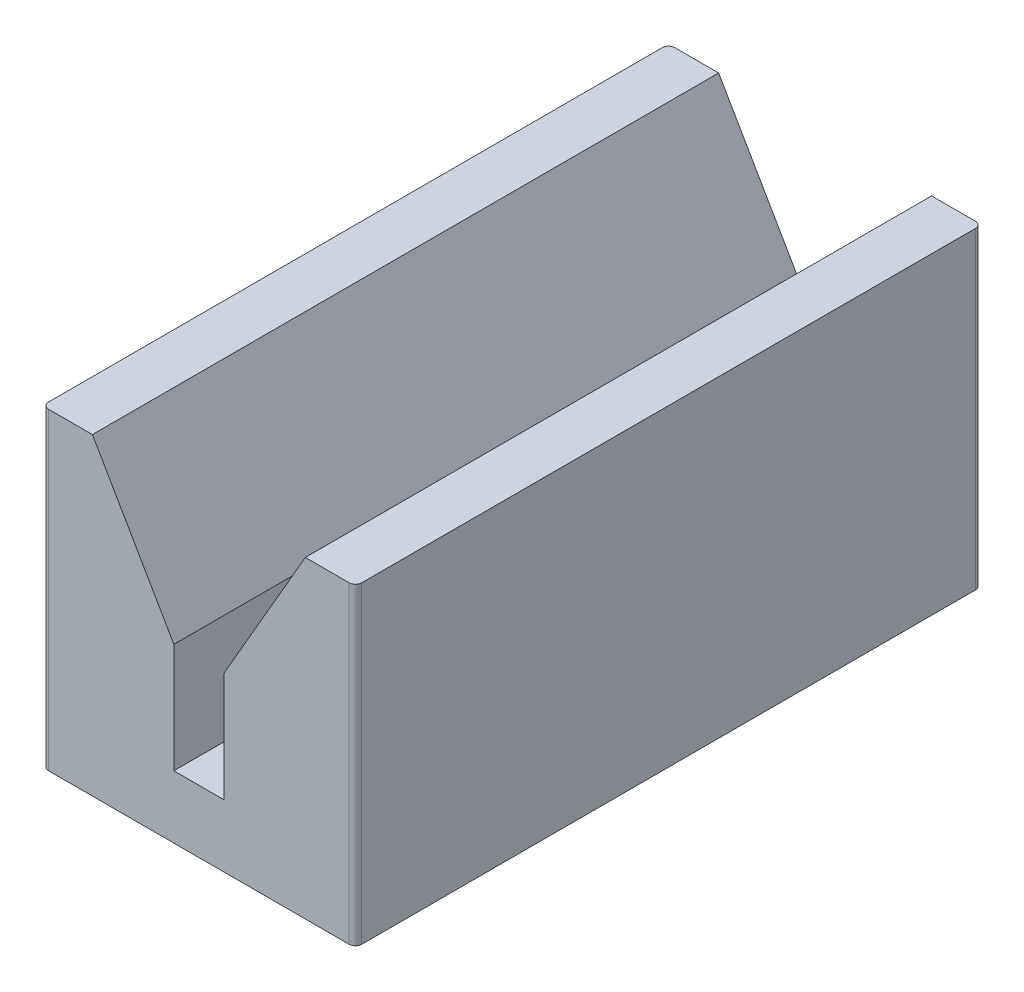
from build123d import *

# Parameters (mm, degrees)
EXTRUSION1_DEPTH        = 25
ENL_V_MAT_EXTRU_1_DEPTH = 62.23724357


with BuildPart() as part:
    # Esquisse1 → Extrusion1 (new body)
    with BuildSketch(Plane(origin=(0, 0, 0), x_dir=(1, 0, 0), z_dir=(0, 1, 0))):
        with BuildLine():
            Line((0.5, 50), (24.5, 50))
            ThreePointArc((24.5, 50), (24.853553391, 49.853553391), (25, 49.5))
            Line((25, 49.5), (25, 0.5))
            ThreePointArc((25, 0.5), (24.853553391, 0.146446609), (24.5, 0))
            Line((24.5, 0), (0.5, 0))
            ThreePointArc((0.5, 0), (0.146446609, 0.146446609), (0, 0.5))
            Line((0, 0.5), (0, 49.5))
            ThreePointArc((0, 49.5), (0.146446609, 49.853553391), (0.5, 50))
        make_face()
    extrude(amount=EXTRUSION1_DEPTH)

    # Esquisse2 → Enl_v. mat.-Extru.1 (cut, through all)
    with BuildSketch(Plane.XY):
        Polygon((10.5, 5), (10.5, 13.741669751), (4, 25), (21, 25), (14.5, 13.741669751), (14.5, 5), align=None)
    extrude(amount=-ENL_V_MAT_EXTRU_1_DEPTH, mode=Mode.SUBTRACT)


solid = part.part
